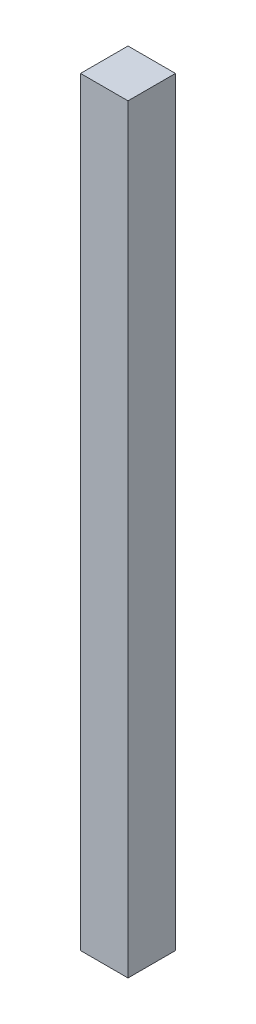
ISO-10303-21;
HEADER;
FILE_DESCRIPTION(('STEP AP214'),'2;1');
FILE_NAME('part.step','',(''),(''),'','','');
FILE_SCHEMA(('AUTOMOTIVE_DESIGN { 1 0 10303 214 1 1 1 1 }'));
ENDSEC;
DATA;
#1=APPLICATION_CONTEXT('core data for automotive mechanical design processes');
#2=APPLICATION_PROTOCOL_DEFINITION('international standard','automotive_design',2000,#1);
#3=PRODUCT_CONTEXT('',#1,'mechanical');
#4=PRODUCT('Part','Part','',(#3));
#5=PRODUCT_RELATED_PRODUCT_CATEGORY('part','',(#4));
#6=PRODUCT_DEFINITION_FORMATION('','',#4);
#7=PRODUCT_DEFINITION_CONTEXT('part definition',#1,'design');
#8=PRODUCT_DEFINITION('design','',#6,#7);
#9=PRODUCT_DEFINITION_SHAPE('','',#8);
#10=(LENGTH_UNIT() NAMED_UNIT(*) SI_UNIT(.MILLI.,.METRE.));
#11=(NAMED_UNIT(*) PLANE_ANGLE_UNIT() SI_UNIT($,.RADIAN.));
#12=(NAMED_UNIT(*) SI_UNIT($,.STERADIAN.) SOLID_ANGLE_UNIT());
#13=UNCERTAINTY_MEASURE_WITH_UNIT(LENGTH_MEASURE(1.E-05),#10,'distance_accuracy_value','');
#14=(GEOMETRIC_REPRESENTATION_CONTEXT(3) GLOBAL_UNCERTAINTY_ASSIGNED_CONTEXT((#13)) GLOBAL_UNIT_ASSIGNED_CONTEXT((#10,
#11,#12)) REPRESENTATION_CONTEXT('',''));
#15=CARTESIAN_POINT('',(0.,0.,0.));
#16=DIRECTION('',(0.,0.,1.));
#17=DIRECTION('',(1.,0.,0.));
#18=AXIS2_PLACEMENT_3D('',#15,#16,#17);
#19=CARTESIAN_POINT('',(25.4,812.8,-25.4));
#20=DIRECTION('',(-1.,0.,0.));
#21=DIRECTION('',(0.,0.,1.));
#22=AXIS2_PLACEMENT_3D('',#19,#20,#21);
#23=PLANE('',#22);
#24=DIRECTION('',(0.,0.,-1.));
#25=VECTOR('',#24,1.);
#26=CARTESIAN_POINT('',(25.4,0.,-25.4));
#27=LINE('',#26,#25);
#28=CARTESIAN_POINT('',(25.4,0.,25.4));
#29=VERTEX_POINT('',#28);
#30=CARTESIAN_POINT('',(25.4,0.,-25.4));
#31=VERTEX_POINT('',#30);
#32=EDGE_CURVE('E96',#29,#31,#27,.T.);
#33=ORIENTED_EDGE('',*,*,#32,.T.);
#34=DIRECTION('',(0.,-1.,0.));
#35=VECTOR('',#34,1.);
#36=CARTESIAN_POINT('',(25.4,812.8,-25.4));
#37=LINE('',#36,#35);
#38=CARTESIAN_POINT('',(25.4,812.8,-25.4));
#39=VERTEX_POINT('',#38);
#40=EDGE_CURVE('E11',#39,#31,#37,.T.);
#41=ORIENTED_EDGE('',*,*,#40,.F.);
#42=DIRECTION('',(0.,0.,-1.));
#43=VECTOR('',#42,1.);
#44=CARTESIAN_POINT('',(25.4,812.8,-25.4));
#45=LINE('',#44,#43);
#46=CARTESIAN_POINT('',(25.4,812.8,25.4));
#47=VERTEX_POINT('',#46);
#48=EDGE_CURVE('E84',#47,#39,#45,.T.);
#49=ORIENTED_EDGE('',*,*,#48,.F.);
#50=DIRECTION('',(0.,-1.,0.));
#51=VECTOR('',#50,1.);
#52=CARTESIAN_POINT('',(25.4,812.8,25.4));
#53=LINE('',#52,#51);
#54=EDGE_CURVE('E92',#47,#29,#53,.T.);
#55=ORIENTED_EDGE('',*,*,#54,.T.);
#56=EDGE_LOOP('',(#33,#41,#49,#55));
#57=FACE_BOUND('',#56,.T.);
#58=ADVANCED_FACE('F33',(#57),#23,.F.);
#59=CARTESIAN_POINT('',(-25.4,812.8,-25.4));
#60=DIRECTION('',(0.,0.,1.));
#61=DIRECTION('',(1.,0.,0.));
#62=AXIS2_PLACEMENT_3D('',#59,#60,#61);
#63=PLANE('',#62);
#64=DIRECTION('',(-1.,0.,0.));
#65=VECTOR('',#64,1.);
#66=CARTESIAN_POINT('',(-25.4,0.,-25.4));
#67=LINE('',#66,#65);
#68=CARTESIAN_POINT('',(-25.4,0.,-25.4));
#69=VERTEX_POINT('',#68);
#70=EDGE_CURVE('E88',#31,#69,#67,.T.);
#71=ORIENTED_EDGE('',*,*,#70,.T.);
#72=DIRECTION('',(0.,-1.,0.));
#73=VECTOR('',#72,1.);
#74=CARTESIAN_POINT('',(-25.4,812.8,-25.4));
#75=LINE('',#74,#73);
#76=CARTESIAN_POINT('',(-25.4,812.8,-25.4));
#77=VERTEX_POINT('',#76);
#78=EDGE_CURVE('E41',#77,#69,#75,.T.);
#79=ORIENTED_EDGE('',*,*,#78,.F.);
#80=DIRECTION('',(-1.,0.,0.));
#81=VECTOR('',#80,1.);
#82=CARTESIAN_POINT('',(-25.4,812.8,-25.4));
#83=LINE('',#82,#81);
#84=EDGE_CURVE('E79',#39,#77,#83,.T.);
#85=ORIENTED_EDGE('',*,*,#84,.F.);
#86=ORIENTED_EDGE('',*,*,#40,.T.);
#87=EDGE_LOOP('',(#71,#79,#85,#86));
#88=FACE_BOUND('',#87,.T.);
#89=ADVANCED_FACE('F87',(#88),#63,.F.);
#90=CARTESIAN_POINT('',(-25.4,812.8,-25.4));
#91=DIRECTION('',(1.,0.,0.));
#92=DIRECTION('',(0.,0.,-1.));
#93=AXIS2_PLACEMENT_3D('',#90,#91,#92);
#94=PLANE('',#93);
#95=DIRECTION('',(0.,0.,1.));
#96=VECTOR('',#95,1.);
#97=CARTESIAN_POINT('',(-25.4,0.,-25.4));
#98=LINE('',#97,#96);
#99=CARTESIAN_POINT('',(-25.4,0.,25.4));
#100=VERTEX_POINT('',#99);
#101=EDGE_CURVE('E66',#69,#100,#98,.T.);
#102=ORIENTED_EDGE('',*,*,#101,.T.);
#103=DIRECTION('',(0.,-1.,0.));
#104=VECTOR('',#103,1.);
#105=CARTESIAN_POINT('',(-25.4,812.8,25.4));
#106=LINE('',#105,#104);
#107=CARTESIAN_POINT('',(-25.4,812.8,25.4));
#108=VERTEX_POINT('',#107);
#109=EDGE_CURVE('E89',#108,#100,#106,.T.);
#110=ORIENTED_EDGE('',*,*,#109,.F.);
#111=DIRECTION('',(0.,0.,1.));
#112=VECTOR('',#111,1.);
#113=CARTESIAN_POINT('',(-25.4,812.8,-25.4));
#114=LINE('',#113,#112);
#115=EDGE_CURVE('E82',#77,#108,#114,.T.);
#116=ORIENTED_EDGE('',*,*,#115,.F.);
#117=ORIENTED_EDGE('',*,*,#78,.T.);
#118=EDGE_LOOP('',(#102,#110,#116,#117));
#119=FACE_BOUND('',#118,.T.);
#120=ADVANCED_FACE('F90',(#119),#94,.F.);
#121=CARTESIAN_POINT('',(-25.4,812.8,25.4));
#122=DIRECTION('',(0.,0.,-1.));
#123=DIRECTION('',(-1.,0.,0.));
#124=AXIS2_PLACEMENT_3D('',#121,#122,#123);
#125=PLANE('',#124);
#126=DIRECTION('',(1.,0.,0.));
#127=VECTOR('',#126,1.);
#128=CARTESIAN_POINT('',(-25.4,0.,25.4));
#129=LINE('',#128,#127);
#130=EDGE_CURVE('E72',#100,#29,#129,.T.);
#131=ORIENTED_EDGE('',*,*,#130,.T.);
#132=ORIENTED_EDGE('',*,*,#54,.F.);
#133=DIRECTION('',(1.,0.,0.));
#134=VECTOR('',#133,1.);
#135=CARTESIAN_POINT('',(-25.4,812.8,25.4));
#136=LINE('',#135,#134);
#137=EDGE_CURVE('E49',#108,#47,#136,.T.);
#138=ORIENTED_EDGE('',*,*,#137,.F.);
#139=ORIENTED_EDGE('',*,*,#109,.T.);
#140=EDGE_LOOP('',(#131,#132,#138,#139));
#141=FACE_BOUND('',#140,.T.);
#142=ADVANCED_FACE('F103',(#141),#125,.F.);
#143=CARTESIAN_POINT('',(0.,812.8,0.));
#144=DIRECTION('',(0.,1.,0.));
#145=DIRECTION('',(0.,0.,1.));
#146=AXIS2_PLACEMENT_3D('',#143,#144,#145);
#147=PLANE('',#146);
#148=ORIENTED_EDGE('',*,*,#48,.T.);
#149=ORIENTED_EDGE('',*,*,#84,.T.);
#150=ORIENTED_EDGE('',*,*,#115,.T.);
#151=ORIENTED_EDGE('',*,*,#137,.T.);
#152=EDGE_LOOP('',(#148,#149,#150,#151));
#153=FACE_BOUND('',#152,.T.);
#154=ADVANCED_FACE('F80',(#153),#147,.T.);
#155=CARTESIAN_POINT('',(0.,0.,0.));
#156=DIRECTION('',(0.,1.,0.));
#157=DIRECTION('',(0.,0.,1.));
#158=AXIS2_PLACEMENT_3D('',#155,#156,#157);
#159=PLANE('',#158);
#160=ORIENTED_EDGE('',*,*,#32,.F.);
#161=ORIENTED_EDGE('',*,*,#130,.F.);
#162=ORIENTED_EDGE('',*,*,#101,.F.);
#163=ORIENTED_EDGE('',*,*,#70,.F.);
#164=EDGE_LOOP('',(#160,#161,#162,#163));
#165=FACE_BOUND('',#164,.T.);
#166=ADVANCED_FACE('F106',(#165),#159,.F.);
#167=CLOSED_SHELL('',(#58,#89,#120,#142,#154,#166));
#168=MANIFOLD_SOLID_BREP('B2',#167);
#169=ADVANCED_BREP_SHAPE_REPRESENTATION('',(#18,#168),#14);
#170=SHAPE_DEFINITION_REPRESENTATION(#9,#169);
ENDSEC;
END-ISO-10303-21;
